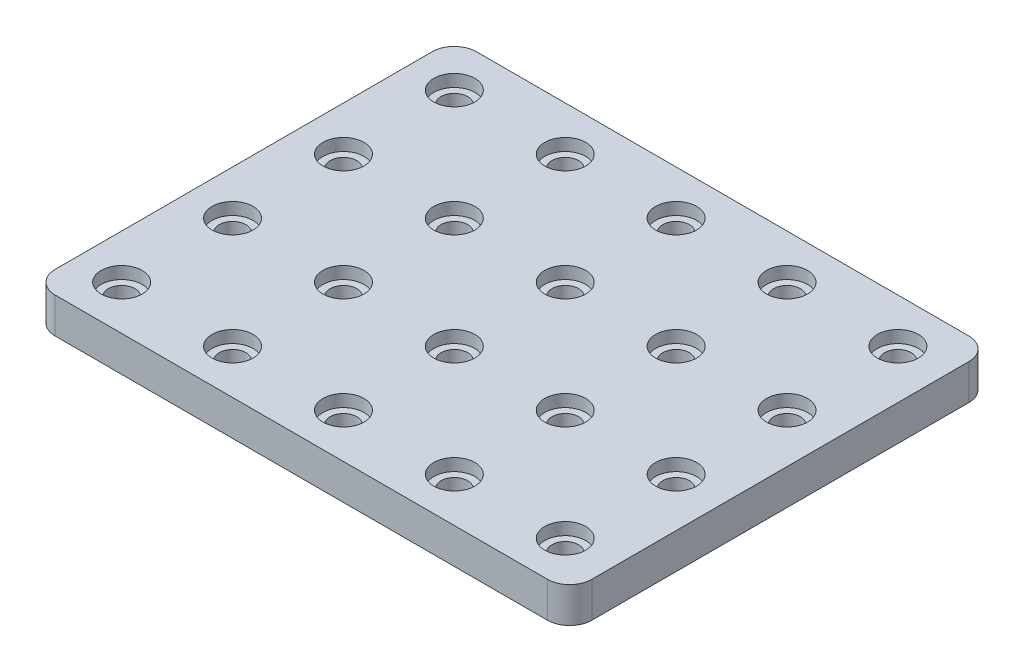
from build123d import *

# Parameters (mm, degrees)
EXTRUDE1_DEPTH                   = 16
CBORE_FOR_M10_SBHCS1_D           = 12
CBORE_FOR_M10_SBHCS1_CBORE_D     = 18.5
CBORE_FOR_M10_SBHCS1_CBORE_DEPTH = 5.5
LPATTERN2_COUNT                  = 4
LPATTERN2_PITCH                  = 50
LPATTERN2_COUNT_DIR2             = 5
LPATTERN2_PITCH_DIR2             = 50


with BuildPart() as part:
    # Sketch1 → Extrude1 (new body)
    with BuildSketch(Plane(origin=(0, 0, 0), x_dir=(1, 0, 0), z_dir=(0, 1, 0))):
        with BuildLine():
            Line((10, 0), (232, 0))
            ThreePointArc((232, 0), (239.071067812, 2.928932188), (242, 10))
            Line((242, 10), (242, 180))
            ThreePointArc((242, 180), (239.071067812, 187.071067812), (232, 190))
            Line((232, 190), (10, 190))
            ThreePointArc((10, 190), (2.928932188, 187.071067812), (0, 180))
            Line((0, 180), (0, 10))
            ThreePointArc((0, 10), (2.928932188, 2.928932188), (10, 0))
        make_face()
    extrude(amount=EXTRUDE1_DEPTH)

    # CBORE for M10 SBHCS1 (through all)
    with Locations(Plane(origin=(0, 16, 0), x_dir=(-1, 0, 0), z_dir=(0, 1, 0))):
        with Locations((-20, -20)):
            cbore_for_m10_sbhcs1 = CounterBoreHole(CBORE_FOR_M10_SBHCS1_D / 2, CBORE_FOR_M10_SBHCS1_CBORE_D / 2, CBORE_FOR_M10_SBHCS1_CBORE_DEPTH)

    # LPattern2: CBORE for M10 SBHCS1 4 × 5
    with Locations(*[(j * LPATTERN2_PITCH_DIR2, 0, -i * LPATTERN2_PITCH) for i in range(LPATTERN2_COUNT) for j in range(LPATTERN2_COUNT_DIR2) if (i, j) != (0, 0)]):
        add(cbore_for_m10_sbhcs1, mode=Mode.SUBTRACT)


solid = part.part
